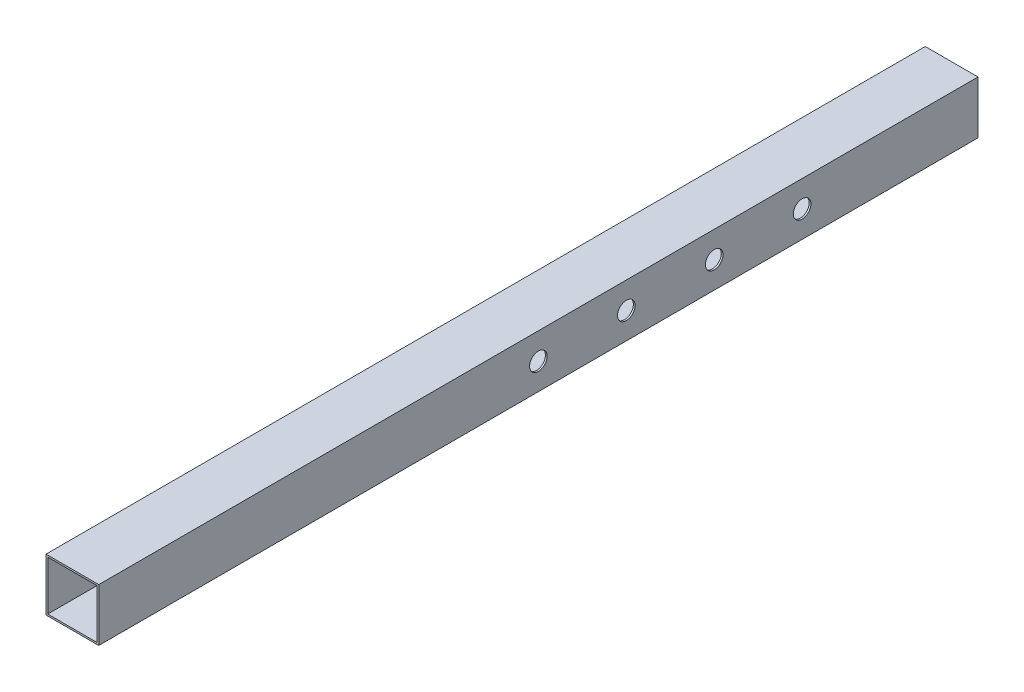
ISO-10303-21;
HEADER;
FILE_DESCRIPTION(('STEP AP214'),'2;1');
FILE_NAME('part.step','',(''),(''),'','','');
FILE_SCHEMA(('AUTOMOTIVE_DESIGN { 1 0 10303 214 1 1 1 1 }'));
ENDSEC;
DATA;
#1=APPLICATION_CONTEXT('core data for automotive mechanical design processes');
#2=APPLICATION_PROTOCOL_DEFINITION('international standard','automotive_design',2000,#1);
#3=PRODUCT_CONTEXT('',#1,'mechanical');
#4=PRODUCT('Part','Part','',(#3));
#5=PRODUCT_RELATED_PRODUCT_CATEGORY('part','',(#4));
#6=PRODUCT_DEFINITION_FORMATION('','',#4);
#7=PRODUCT_DEFINITION_CONTEXT('part definition',#1,'design');
#8=PRODUCT_DEFINITION('design','',#6,#7);
#9=PRODUCT_DEFINITION_SHAPE('','',#8);
#10=(LENGTH_UNIT() NAMED_UNIT(*) SI_UNIT(.MILLI.,.METRE.));
#11=(NAMED_UNIT(*) PLANE_ANGLE_UNIT() SI_UNIT($,.RADIAN.));
#12=(NAMED_UNIT(*) SI_UNIT($,.STERADIAN.) SOLID_ANGLE_UNIT());
#13=UNCERTAINTY_MEASURE_WITH_UNIT(LENGTH_MEASURE(1.E-05),#10,'distance_accuracy_value','');
#14=(GEOMETRIC_REPRESENTATION_CONTEXT(3) GLOBAL_UNCERTAINTY_ASSIGNED_CONTEXT((#13)) GLOBAL_UNIT_ASSIGNED_CONTEXT((#10,
#11,#12)) REPRESENTATION_CONTEXT('',''));
#15=CARTESIAN_POINT('',(0.,0.,0.));
#16=DIRECTION('',(0.,0.,1.));
#17=DIRECTION('',(1.,0.,0.));
#18=AXIS2_PLACEMENT_3D('',#15,#16,#17);
#19=CARTESIAN_POINT('',(0.,0.,500.));
#20=DIRECTION('',(0.,0.,1.));
#21=DIRECTION('',(1.,0.,0.));
#22=AXIS2_PLACEMENT_3D('',#19,#20,#21);
#23=PLANE('',#22);
#24=DIRECTION('',(0.,1.,0.));
#25=VECTOR('',#24,1.);
#26=CARTESIAN_POINT('',(15.,-15.,500.));
#27=LINE('',#26,#25);
#28=CARTESIAN_POINT('',(15.,-15.,500.));
#29=VERTEX_POINT('',#28);
#30=CARTESIAN_POINT('',(15.,15.,500.));
#31=VERTEX_POINT('',#30);
#32=EDGE_CURVE('E176',#29,#31,#27,.T.);
#33=ORIENTED_EDGE('',*,*,#32,.T.);
#34=DIRECTION('',(-1.,0.,0.));
#35=VECTOR('',#34,1.);
#36=CARTESIAN_POINT('',(-15.,15.,500.));
#37=LINE('',#36,#35);
#38=CARTESIAN_POINT('',(-15.,15.,500.));
#39=VERTEX_POINT('',#38);
#40=EDGE_CURVE('E179',#31,#39,#37,.T.);
#41=ORIENTED_EDGE('',*,*,#40,.T.);
#42=DIRECTION('',(0.,-1.,0.));
#43=VECTOR('',#42,1.);
#44=CARTESIAN_POINT('',(-15.,-15.,500.));
#45=LINE('',#44,#43);
#46=CARTESIAN_POINT('',(-15.,-15.,500.));
#47=VERTEX_POINT('',#46);
#48=EDGE_CURVE('E182',#39,#47,#45,.T.);
#49=ORIENTED_EDGE('',*,*,#48,.T.);
#50=DIRECTION('',(1.,0.,0.));
#51=VECTOR('',#50,1.);
#52=CARTESIAN_POINT('',(-15.,-15.,500.));
#53=LINE('',#52,#51);
#54=EDGE_CURVE('E184',#47,#29,#53,.T.);
#55=ORIENTED_EDGE('',*,*,#54,.T.);
#56=EDGE_LOOP('',(#33,#41,#49,#55));
#57=FACE_BOUND('',#56,.T.);
#58=DIRECTION('',(-1.,0.,0.));
#59=VECTOR('',#58,1.);
#60=CARTESIAN_POINT('',(0.,14.,500.));
#61=LINE('',#60,#59);
#62=CARTESIAN_POINT('',(14.,14.,500.));
#63=VERTEX_POINT('',#62);
#64=CARTESIAN_POINT('',(-14.,14.,500.));
#65=VERTEX_POINT('',#64);
#66=EDGE_CURVE('E146',#63,#65,#61,.T.);
#67=ORIENTED_EDGE('',*,*,#66,.F.);
#68=DIRECTION('',(0.,1.,0.));
#69=VECTOR('',#68,1.);
#70=CARTESIAN_POINT('',(14.,0.,500.));
#71=LINE('',#70,#69);
#72=CARTESIAN_POINT('',(14.,-14.,500.));
#73=VERTEX_POINT('',#72);
#74=EDGE_CURVE('E138',#73,#63,#71,.T.);
#75=ORIENTED_EDGE('',*,*,#74,.F.);
#76=DIRECTION('',(1.,0.,0.));
#77=VECTOR('',#76,1.);
#78=CARTESIAN_POINT('',(0.,-14.,500.));
#79=LINE('',#78,#77);
#80=CARTESIAN_POINT('',(-14.,-14.,500.));
#81=VERTEX_POINT('',#80);
#82=EDGE_CURVE('E160',#81,#73,#79,.T.);
#83=ORIENTED_EDGE('',*,*,#82,.F.);
#84=DIRECTION('',(0.,-1.,0.));
#85=VECTOR('',#84,1.);
#86=CARTESIAN_POINT('',(-14.,0.,500.));
#87=LINE('',#86,#85);
#88=EDGE_CURVE('E158',#65,#81,#87,.T.);
#89=ORIENTED_EDGE('',*,*,#88,.F.);
#90=EDGE_LOOP('',(#67,#75,#83,#89));
#91=FACE_BOUND('',#90,.T.);
#92=ADVANCED_FACE('F70',(#57,#91),#23,.T.);
#93=CARTESIAN_POINT('',(0.,0.,0.));
#94=DIRECTION('',(0.,0.,1.));
#95=DIRECTION('',(1.,0.,0.));
#96=AXIS2_PLACEMENT_3D('',#93,#94,#95);
#97=PLANE('',#96);
#98=DIRECTION('',(0.,1.,0.));
#99=VECTOR('',#98,1.);
#100=CARTESIAN_POINT('',(15.,-15.,0.));
#101=LINE('',#100,#99);
#102=CARTESIAN_POINT('',(15.,-15.,0.));
#103=VERTEX_POINT('',#102);
#104=CARTESIAN_POINT('',(15.,15.,0.));
#105=VERTEX_POINT('',#104);
#106=EDGE_CURVE('E154',#103,#105,#101,.T.);
#107=ORIENTED_EDGE('',*,*,#106,.F.);
#108=DIRECTION('',(1.,0.,0.));
#109=VECTOR('',#108,1.);
#110=CARTESIAN_POINT('',(-15.,-15.,0.));
#111=LINE('',#110,#109);
#112=CARTESIAN_POINT('',(-15.,-15.,0.));
#113=VERTEX_POINT('',#112);
#114=EDGE_CURVE('E180',#113,#103,#111,.T.);
#115=ORIENTED_EDGE('',*,*,#114,.F.);
#116=DIRECTION('',(0.,-1.,0.));
#117=VECTOR('',#116,1.);
#118=CARTESIAN_POINT('',(-15.,-15.,0.));
#119=LINE('',#118,#117);
#120=CARTESIAN_POINT('',(-15.,15.,0.));
#121=VERTEX_POINT('',#120);
#122=EDGE_CURVE('E191',#121,#113,#119,.T.);
#123=ORIENTED_EDGE('',*,*,#122,.F.);
#124=DIRECTION('',(-1.,0.,0.));
#125=VECTOR('',#124,1.);
#126=CARTESIAN_POINT('',(-15.,15.,0.));
#127=LINE('',#126,#125);
#128=EDGE_CURVE('E189',#105,#121,#127,.T.);
#129=ORIENTED_EDGE('',*,*,#128,.F.);
#130=EDGE_LOOP('',(#107,#115,#123,#129));
#131=FACE_BOUND('',#130,.T.);
#132=DIRECTION('',(0.,1.,0.));
#133=VECTOR('',#132,1.);
#134=CARTESIAN_POINT('',(14.,0.,0.));
#135=LINE('',#134,#133);
#136=CARTESIAN_POINT('',(14.,-14.,0.));
#137=VERTEX_POINT('',#136);
#138=CARTESIAN_POINT('',(14.,14.,0.));
#139=VERTEX_POINT('',#138);
#140=EDGE_CURVE('E96',#137,#139,#135,.T.);
#141=ORIENTED_EDGE('',*,*,#140,.T.);
#142=DIRECTION('',(-1.,0.,0.));
#143=VECTOR('',#142,1.);
#144=CARTESIAN_POINT('',(0.,14.,0.));
#145=LINE('',#144,#143);
#146=CARTESIAN_POINT('',(-14.,14.,0.));
#147=VERTEX_POINT('',#146);
#148=EDGE_CURVE('E153',#139,#147,#145,.T.);
#149=ORIENTED_EDGE('',*,*,#148,.T.);
#150=DIRECTION('',(0.,-1.,0.));
#151=VECTOR('',#150,1.);
#152=CARTESIAN_POINT('',(-14.,0.,0.));
#153=LINE('',#152,#151);
#154=CARTESIAN_POINT('',(-14.,-14.,0.));
#155=VERTEX_POINT('',#154);
#156=EDGE_CURVE('E168',#147,#155,#153,.T.);
#157=ORIENTED_EDGE('',*,*,#156,.T.);
#158=DIRECTION('',(1.,0.,0.));
#159=VECTOR('',#158,1.);
#160=CARTESIAN_POINT('',(0.,-14.,0.));
#161=LINE('',#160,#159);
#162=EDGE_CURVE('E147',#155,#137,#161,.T.);
#163=ORIENTED_EDGE('',*,*,#162,.T.);
#164=EDGE_LOOP('',(#141,#149,#157,#163));
#165=FACE_BOUND('',#164,.T.);
#166=ADVANCED_FACE('F245',(#131,#165),#97,.F.);
#167=CARTESIAN_POINT('',(15.,-15.,500.));
#168=DIRECTION('',(-1.,0.,0.));
#169=DIRECTION('',(0.,0.,1.));
#170=AXIS2_PLACEMENT_3D('',#167,#168,#169);
#171=PLANE('',#170);
#172=CARTESIAN_POINT('',(15.,0.,100.));
#173=DIRECTION('',(1.,0.,0.));
#174=DIRECTION('',(0.,0.,-1.));
#175=AXIS2_PLACEMENT_3D('',#172,#173,#174);
#176=CIRCLE('',#175,5.);
#177=CARTESIAN_POINT('',(15.,0.,95.));
#178=VERTEX_POINT('',#177);
#179=EDGE_CURVE('E298',#178,#178,#176,.T.);
#180=ORIENTED_EDGE('',*,*,#179,.F.);
#181=EDGE_LOOP('',(#180));
#182=FACE_BOUND('',#181,.T.);
#183=CARTESIAN_POINT('',(15.,-3.49148133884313E-13,150.));
#184=DIRECTION('',(1.,0.,0.));
#185=DIRECTION('',(0.,0.,-1.));
#186=AXIS2_PLACEMENT_3D('',#183,#184,#185);
#187=CIRCLE('',#186,4.99999999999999);
#188=CARTESIAN_POINT('',(15.,-3.49148133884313E-13,145.));
#189=VERTEX_POINT('',#188);
#190=EDGE_CURVE('E302',#189,#189,#187,.T.);
#191=ORIENTED_EDGE('',*,*,#190,.F.);
#192=EDGE_LOOP('',(#191));
#193=FACE_BOUND('',#192,.T.);
#194=CARTESIAN_POINT('',(15.,-6.98296267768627E-13,200.));
#195=DIRECTION('',(1.,0.,0.));
#196=DIRECTION('',(0.,0.,-1.));
#197=AXIS2_PLACEMENT_3D('',#194,#195,#196);
#198=CIRCLE('',#197,4.99999999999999);
#199=CARTESIAN_POINT('',(15.,-6.98296267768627E-13,195.));
#200=VERTEX_POINT('',#199);
#201=EDGE_CURVE('E306',#200,#200,#198,.T.);
#202=ORIENTED_EDGE('',*,*,#201,.F.);
#203=EDGE_LOOP('',(#202));
#204=FACE_BOUND('',#203,.T.);
#205=CARTESIAN_POINT('',(15.,-1.04744440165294E-12,250.));
#206=DIRECTION('',(1.,0.,0.));
#207=DIRECTION('',(0.,0.,-1.));
#208=AXIS2_PLACEMENT_3D('',#205,#206,#207);
#209=CIRCLE('',#208,4.99999999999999);
#210=CARTESIAN_POINT('',(15.,-1.04744440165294E-12,245.));
#211=VERTEX_POINT('',#210);
#212=EDGE_CURVE('E309',#211,#211,#209,.T.);
#213=ORIENTED_EDGE('',*,*,#212,.F.);
#214=EDGE_LOOP('',(#213));
#215=FACE_BOUND('',#214,.T.);
#216=ORIENTED_EDGE('',*,*,#106,.T.);
#217=DIRECTION('',(0.,0.,-1.));
#218=VECTOR('',#217,1.);
#219=CARTESIAN_POINT('',(15.,15.,500.));
#220=LINE('',#219,#218);
#221=EDGE_CURVE('E13',#31,#105,#220,.T.);
#222=ORIENTED_EDGE('',*,*,#221,.F.);
#223=ORIENTED_EDGE('',*,*,#32,.F.);
#224=DIRECTION('',(0.,0.,-1.));
#225=VECTOR('',#224,1.);
#226=CARTESIAN_POINT('',(15.,-15.,500.));
#227=LINE('',#226,#225);
#228=EDGE_CURVE('E186',#29,#103,#227,.T.);
#229=ORIENTED_EDGE('',*,*,#228,.T.);
#230=EDGE_LOOP('',(#216,#222,#223,#229));
#231=FACE_BOUND('',#230,.T.);
#232=ADVANCED_FACE('F72',(#182,#193,#204,#215,#231),#171,.F.);
#233=CARTESIAN_POINT('',(-15.,15.,500.));
#234=DIRECTION('',(0.,-1.,0.));
#235=DIRECTION('',(0.,0.,-1.));
#236=AXIS2_PLACEMENT_3D('',#233,#234,#235);
#237=PLANE('',#236);
#238=ORIENTED_EDGE('',*,*,#128,.T.);
#239=DIRECTION('',(0.,0.,-1.));
#240=VECTOR('',#239,1.);
#241=CARTESIAN_POINT('',(-15.,15.,500.));
#242=LINE('',#241,#240);
#243=EDGE_CURVE('E80',#39,#121,#242,.T.);
#244=ORIENTED_EDGE('',*,*,#243,.F.);
#245=ORIENTED_EDGE('',*,*,#40,.F.);
#246=ORIENTED_EDGE('',*,*,#221,.T.);
#247=EDGE_LOOP('',(#238,#244,#245,#246));
#248=FACE_BOUND('',#247,.T.);
#249=ADVANCED_FACE('F273',(#248),#237,.F.);
#250=CARTESIAN_POINT('',(-15.,-15.,500.));
#251=DIRECTION('',(1.,0.,0.));
#252=DIRECTION('',(0.,0.,-1.));
#253=AXIS2_PLACEMENT_3D('',#250,#251,#252);
#254=PLANE('',#253);
#255=CARTESIAN_POINT('',(-15.,0.,100.));
#256=DIRECTION('',(1.,0.,0.));
#257=DIRECTION('',(0.,0.,-1.));
#258=AXIS2_PLACEMENT_3D('',#255,#256,#257);
#259=CIRCLE('',#258,5.);
#260=CARTESIAN_POINT('',(-15.,0.,95.));
#261=VERTEX_POINT('',#260);
#262=EDGE_CURVE('E206',#261,#261,#259,.F.);
#263=ORIENTED_EDGE('',*,*,#262,.F.);
#264=EDGE_LOOP('',(#263));
#265=FACE_BOUND('',#264,.T.);
#266=CARTESIAN_POINT('',(-15.,-3.49148133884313E-13,150.));
#267=DIRECTION('',(1.,0.,0.));
#268=DIRECTION('',(0.,0.,-1.));
#269=AXIS2_PLACEMENT_3D('',#266,#267,#268);
#270=CIRCLE('',#269,4.99999999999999);
#271=CARTESIAN_POINT('',(-15.,-3.49148133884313E-13,145.));
#272=VERTEX_POINT('',#271);
#273=EDGE_CURVE('E323',#272,#272,#270,.F.);
#274=ORIENTED_EDGE('',*,*,#273,.F.);
#275=EDGE_LOOP('',(#274));
#276=FACE_BOUND('',#275,.T.);
#277=CARTESIAN_POINT('',(-15.,-6.98296267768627E-13,200.));
#278=DIRECTION('',(1.,0.,0.));
#279=DIRECTION('',(0.,0.,-1.));
#280=AXIS2_PLACEMENT_3D('',#277,#278,#279);
#281=CIRCLE('',#280,4.99999999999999);
#282=CARTESIAN_POINT('',(-15.,-6.98296267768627E-13,195.));
#283=VERTEX_POINT('',#282);
#284=EDGE_CURVE('E319',#283,#283,#281,.F.);
#285=ORIENTED_EDGE('',*,*,#284,.F.);
#286=EDGE_LOOP('',(#285));
#287=FACE_BOUND('',#286,.T.);
#288=CARTESIAN_POINT('',(-15.,-1.04744440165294E-12,250.));
#289=DIRECTION('',(1.,0.,0.));
#290=DIRECTION('',(0.,0.,-1.));
#291=AXIS2_PLACEMENT_3D('',#288,#289,#290);
#292=CIRCLE('',#291,4.99999999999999);
#293=CARTESIAN_POINT('',(-15.,-1.04744440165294E-12,245.));
#294=VERTEX_POINT('',#293);
#295=EDGE_CURVE('E312',#294,#294,#292,.F.);
#296=ORIENTED_EDGE('',*,*,#295,.F.);
#297=EDGE_LOOP('',(#296));
#298=FACE_BOUND('',#297,.T.);
#299=ORIENTED_EDGE('',*,*,#122,.T.);
#300=DIRECTION('',(0.,0.,-1.));
#301=VECTOR('',#300,1.);
#302=CARTESIAN_POINT('',(-15.,-15.,500.));
#303=LINE('',#302,#301);
#304=EDGE_CURVE('E196',#47,#113,#303,.T.);
#305=ORIENTED_EDGE('',*,*,#304,.F.);
#306=ORIENTED_EDGE('',*,*,#48,.F.);
#307=ORIENTED_EDGE('',*,*,#243,.T.);
#308=EDGE_LOOP('',(#299,#305,#306,#307));
#309=FACE_BOUND('',#308,.T.);
#310=ADVANCED_FACE('F270',(#265,#276,#287,#298,#309),#254,.F.);
#311=CARTESIAN_POINT('',(-15.,-15.,500.));
#312=DIRECTION('',(0.,1.,0.));
#313=DIRECTION('',(0.,0.,1.));
#314=AXIS2_PLACEMENT_3D('',#311,#312,#313);
#315=PLANE('',#314);
#316=ORIENTED_EDGE('',*,*,#114,.T.);
#317=ORIENTED_EDGE('',*,*,#228,.F.);
#318=ORIENTED_EDGE('',*,*,#54,.F.);
#319=ORIENTED_EDGE('',*,*,#304,.T.);
#320=EDGE_LOOP('',(#316,#317,#318,#319));
#321=FACE_BOUND('',#320,.T.);
#322=ADVANCED_FACE('F267',(#321),#315,.F.);
#323=CARTESIAN_POINT('',(14.,0.,500.));
#324=DIRECTION('',(-1.,0.,0.));
#325=DIRECTION('',(0.,0.,1.));
#326=AXIS2_PLACEMENT_3D('',#323,#324,#325);
#327=PLANE('',#326);
#328=CARTESIAN_POINT('',(14.,0.,100.));
#329=DIRECTION('',(-1.,0.,0.));
#330=DIRECTION('',(0.,0.,1.));
#331=AXIS2_PLACEMENT_3D('',#328,#329,#330);
#332=CIRCLE('',#331,5.);
#333=CARTESIAN_POINT('',(14.,0.,105.));
#334=VERTEX_POINT('',#333);
#335=EDGE_CURVE('E166',#334,#334,#332,.T.);
#336=ORIENTED_EDGE('',*,*,#335,.F.);
#337=EDGE_LOOP('',(#336));
#338=FACE_BOUND('',#337,.T.);
#339=CARTESIAN_POINT('',(14.,-3.49148133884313E-13,150.));
#340=DIRECTION('',(-1.,0.,0.));
#341=DIRECTION('',(0.,0.,1.));
#342=AXIS2_PLACEMENT_3D('',#339,#340,#341);
#343=CIRCLE('',#342,4.99999999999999);
#344=CARTESIAN_POINT('',(14.,-3.49148133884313E-13,155.));
#345=VERTEX_POINT('',#344);
#346=EDGE_CURVE('E213',#345,#345,#343,.T.);
#347=ORIENTED_EDGE('',*,*,#346,.F.);
#348=EDGE_LOOP('',(#347));
#349=FACE_BOUND('',#348,.T.);
#350=CARTESIAN_POINT('',(14.,-6.98296267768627E-13,200.));
#351=DIRECTION('',(-1.,0.,0.));
#352=DIRECTION('',(0.,0.,1.));
#353=AXIS2_PLACEMENT_3D('',#350,#351,#352);
#354=CIRCLE('',#353,4.99999999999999);
#355=CARTESIAN_POINT('',(14.,-6.98296267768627E-13,205.));
#356=VERTEX_POINT('',#355);
#357=EDGE_CURVE('E210',#356,#356,#354,.T.);
#358=ORIENTED_EDGE('',*,*,#357,.F.);
#359=EDGE_LOOP('',(#358));
#360=FACE_BOUND('',#359,.T.);
#361=CARTESIAN_POINT('',(14.,-1.04744440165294E-12,250.));
#362=DIRECTION('',(-1.,0.,0.));
#363=DIRECTION('',(0.,0.,1.));
#364=AXIS2_PLACEMENT_3D('',#361,#362,#363);
#365=CIRCLE('',#364,4.99999999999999);
#366=CARTESIAN_POINT('',(14.,-1.04744440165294E-12,255.));
#367=VERTEX_POINT('',#366);
#368=EDGE_CURVE('E205',#367,#367,#365,.T.);
#369=ORIENTED_EDGE('',*,*,#368,.F.);
#370=EDGE_LOOP('',(#369));
#371=FACE_BOUND('',#370,.T.);
#372=ORIENTED_EDGE('',*,*,#140,.F.);
#373=DIRECTION('',(0.,0.,-1.));
#374=VECTOR('',#373,1.);
#375=CARTESIAN_POINT('',(14.,-14.,500.));
#376=LINE('',#375,#374);
#377=EDGE_CURVE('E142',#73,#137,#376,.T.);
#378=ORIENTED_EDGE('',*,*,#377,.F.);
#379=ORIENTED_EDGE('',*,*,#74,.T.);
#380=DIRECTION('',(0.,0.,-1.));
#381=VECTOR('',#380,1.);
#382=CARTESIAN_POINT('',(14.,14.,500.));
#383=LINE('',#382,#381);
#384=EDGE_CURVE('E141',#63,#139,#383,.T.);
#385=ORIENTED_EDGE('',*,*,#384,.T.);
#386=EDGE_LOOP('',(#372,#378,#379,#385));
#387=FACE_BOUND('',#386,.T.);
#388=ADVANCED_FACE('F140',(#338,#349,#360,#371,#387),#327,.T.);
#389=CARTESIAN_POINT('',(0.,14.,500.));
#390=DIRECTION('',(0.,-1.,0.));
#391=DIRECTION('',(0.,0.,-1.));
#392=AXIS2_PLACEMENT_3D('',#389,#390,#391);
#393=PLANE('',#392);
#394=ORIENTED_EDGE('',*,*,#148,.F.);
#395=ORIENTED_EDGE('',*,*,#384,.F.);
#396=ORIENTED_EDGE('',*,*,#66,.T.);
#397=DIRECTION('',(0.,0.,-1.));
#398=VECTOR('',#397,1.);
#399=CARTESIAN_POINT('',(-14.,14.,500.));
#400=LINE('',#399,#398);
#401=EDGE_CURVE('E155',#65,#147,#400,.T.);
#402=ORIENTED_EDGE('',*,*,#401,.T.);
#403=EDGE_LOOP('',(#394,#395,#396,#402));
#404=FACE_BOUND('',#403,.T.);
#405=ADVANCED_FACE('F150',(#404),#393,.T.);
#406=CARTESIAN_POINT('',(-14.,0.,500.));
#407=DIRECTION('',(1.,0.,0.));
#408=DIRECTION('',(0.,0.,-1.));
#409=AXIS2_PLACEMENT_3D('',#406,#407,#408);
#410=PLANE('',#409);
#411=CARTESIAN_POINT('',(-14.,0.,100.));
#412=DIRECTION('',(1.,0.,0.));
#413=DIRECTION('',(0.,0.,-1.));
#414=AXIS2_PLACEMENT_3D('',#411,#412,#413);
#415=CIRCLE('',#414,5.);
#416=CARTESIAN_POINT('',(-14.,0.,95.));
#417=VERTEX_POINT('',#416);
#418=EDGE_CURVE('E74',#417,#417,#415,.T.);
#419=ORIENTED_EDGE('',*,*,#418,.F.);
#420=EDGE_LOOP('',(#419));
#421=FACE_BOUND('',#420,.T.);
#422=CARTESIAN_POINT('',(-14.,-3.49148133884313E-13,150.));
#423=DIRECTION('',(1.,0.,0.));
#424=DIRECTION('',(0.,0.,-1.));
#425=AXIS2_PLACEMENT_3D('',#422,#423,#424);
#426=CIRCLE('',#425,4.99999999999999);
#427=CARTESIAN_POINT('',(-14.,-3.49148133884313E-13,145.));
#428=VERTEX_POINT('',#427);
#429=EDGE_CURVE('E211',#428,#428,#426,.T.);
#430=ORIENTED_EDGE('',*,*,#429,.F.);
#431=EDGE_LOOP('',(#430));
#432=FACE_BOUND('',#431,.T.);
#433=CARTESIAN_POINT('',(-14.,-6.98296267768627E-13,200.));
#434=DIRECTION('',(1.,0.,0.));
#435=DIRECTION('',(0.,0.,-1.));
#436=AXIS2_PLACEMENT_3D('',#433,#434,#435);
#437=CIRCLE('',#436,4.99999999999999);
#438=CARTESIAN_POINT('',(-14.,-6.98296267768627E-13,195.));
#439=VERTEX_POINT('',#438);
#440=EDGE_CURVE('E207',#439,#439,#437,.T.);
#441=ORIENTED_EDGE('',*,*,#440,.F.);
#442=EDGE_LOOP('',(#441));
#443=FACE_BOUND('',#442,.T.);
#444=CARTESIAN_POINT('',(-14.,-1.04744440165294E-12,250.));
#445=DIRECTION('',(1.,0.,0.));
#446=DIRECTION('',(0.,0.,-1.));
#447=AXIS2_PLACEMENT_3D('',#444,#445,#446);
#448=CIRCLE('',#447,4.99999999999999);
#449=CARTESIAN_POINT('',(-14.,-1.04744440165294E-12,245.));
#450=VERTEX_POINT('',#449);
#451=EDGE_CURVE('E200',#450,#450,#448,.T.);
#452=ORIENTED_EDGE('',*,*,#451,.F.);
#453=EDGE_LOOP('',(#452));
#454=FACE_BOUND('',#453,.T.);
#455=ORIENTED_EDGE('',*,*,#156,.F.);
#456=ORIENTED_EDGE('',*,*,#401,.F.);
#457=ORIENTED_EDGE('',*,*,#88,.T.);
#458=DIRECTION('',(0.,0.,-1.));
#459=VECTOR('',#458,1.);
#460=CARTESIAN_POINT('',(-14.,-14.,500.));
#461=LINE('',#460,#459);
#462=EDGE_CURVE('E88',#81,#155,#461,.T.);
#463=ORIENTED_EDGE('',*,*,#462,.T.);
#464=EDGE_LOOP('',(#455,#456,#457,#463));
#465=FACE_BOUND('',#464,.T.);
#466=ADVANCED_FACE('F233',(#421,#432,#443,#454,#465),#410,.T.);
#467=CARTESIAN_POINT('',(0.,-14.,500.));
#468=DIRECTION('',(0.,1.,0.));
#469=DIRECTION('',(0.,0.,1.));
#470=AXIS2_PLACEMENT_3D('',#467,#468,#469);
#471=PLANE('',#470);
#472=ORIENTED_EDGE('',*,*,#162,.F.);
#473=ORIENTED_EDGE('',*,*,#462,.F.);
#474=ORIENTED_EDGE('',*,*,#82,.T.);
#475=ORIENTED_EDGE('',*,*,#377,.T.);
#476=EDGE_LOOP('',(#472,#473,#474,#475));
#477=FACE_BOUND('',#476,.T.);
#478=ADVANCED_FACE('F236',(#477),#471,.T.);
#479=CARTESIAN_POINT('',(-29.142135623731,-1.04744440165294E-12,250.));
#480=DIRECTION('',(1.,0.,0.));
#481=DIRECTION('',(0.,0.,-1.));
#482=AXIS2_PLACEMENT_3D('',#479,#480,#481);
#483=CYLINDRICAL_SURFACE('',#482,4.99999999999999);
#484=ORIENTED_EDGE('',*,*,#451,.T.);
#485=EDGE_LOOP('',(#484));
#486=FACE_BOUND('',#485,.T.);
#487=ORIENTED_EDGE('',*,*,#295,.T.);
#488=EDGE_LOOP('',(#487));
#489=FACE_BOUND('',#488,.T.);
#490=ADVANCED_FACE('F247',(#486,#489),#483,.F.);
#491=CARTESIAN_POINT('',(-29.142135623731,-6.98296267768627E-13,200.));
#492=DIRECTION('',(1.,0.,0.));
#493=DIRECTION('',(0.,0.,-1.));
#494=AXIS2_PLACEMENT_3D('',#491,#492,#493);
#495=CYLINDRICAL_SURFACE('',#494,4.99999999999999);
#496=ORIENTED_EDGE('',*,*,#440,.T.);
#497=EDGE_LOOP('',(#496));
#498=FACE_BOUND('',#497,.T.);
#499=ORIENTED_EDGE('',*,*,#284,.T.);
#500=EDGE_LOOP('',(#499));
#501=FACE_BOUND('',#500,.T.);
#502=ADVANCED_FACE('F252',(#498,#501),#495,.F.);
#503=CARTESIAN_POINT('',(-29.142135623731,-3.49148133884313E-13,150.));
#504=DIRECTION('',(1.,0.,0.));
#505=DIRECTION('',(0.,0.,-1.));
#506=AXIS2_PLACEMENT_3D('',#503,#504,#505);
#507=CYLINDRICAL_SURFACE('',#506,4.99999999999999);
#508=ORIENTED_EDGE('',*,*,#429,.T.);
#509=EDGE_LOOP('',(#508));
#510=FACE_BOUND('',#509,.T.);
#511=ORIENTED_EDGE('',*,*,#273,.T.);
#512=EDGE_LOOP('',(#511));
#513=FACE_BOUND('',#512,.T.);
#514=ADVANCED_FACE('F340',(#510,#513),#507,.F.);
#515=CARTESIAN_POINT('',(-29.142135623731,0.,100.));
#516=DIRECTION('',(1.,0.,0.));
#517=DIRECTION('',(0.,0.,-1.));
#518=AXIS2_PLACEMENT_3D('',#515,#516,#517);
#519=CYLINDRICAL_SURFACE('',#518,5.);
#520=ORIENTED_EDGE('',*,*,#418,.T.);
#521=EDGE_LOOP('',(#520));
#522=FACE_BOUND('',#521,.T.);
#523=ORIENTED_EDGE('',*,*,#262,.T.);
#524=EDGE_LOOP('',(#523));
#525=FACE_BOUND('',#524,.T.);
#526=ADVANCED_FACE('F230',(#522,#525),#519,.F.);
#527=ORIENTED_EDGE('',*,*,#368,.T.);
#528=EDGE_LOOP('',(#527));
#529=FACE_BOUND('',#528,.T.);
#530=ORIENTED_EDGE('',*,*,#212,.T.);
#531=EDGE_LOOP('',(#530));
#532=FACE_BOUND('',#531,.T.);
#533=ADVANCED_FACE('F255',(#529,#532),#483,.F.);
#534=ORIENTED_EDGE('',*,*,#357,.T.);
#535=EDGE_LOOP('',(#534));
#536=FACE_BOUND('',#535,.T.);
#537=ORIENTED_EDGE('',*,*,#201,.T.);
#538=EDGE_LOOP('',(#537));
#539=FACE_BOUND('',#538,.T.);
#540=ADVANCED_FACE('F337',(#536,#539),#495,.F.);
#541=ORIENTED_EDGE('',*,*,#346,.T.);
#542=EDGE_LOOP('',(#541));
#543=FACE_BOUND('',#542,.T.);
#544=ORIENTED_EDGE('',*,*,#190,.T.);
#545=EDGE_LOOP('',(#544));
#546=FACE_BOUND('',#545,.T.);
#547=ADVANCED_FACE('F332',(#543,#546),#507,.F.);
#548=ORIENTED_EDGE('',*,*,#335,.T.);
#549=EDGE_LOOP('',(#548));
#550=FACE_BOUND('',#549,.T.);
#551=ORIENTED_EDGE('',*,*,#179,.T.);
#552=EDGE_LOOP('',(#551));
#553=FACE_BOUND('',#552,.T.);
#554=ADVANCED_FACE('F330',(#550,#553),#519,.F.);
#555=CLOSED_SHELL('',(#92,#166,#232,#249,#310,#322,#388,#405,#466,#478,#490,#502,#514,#526,#533,
#540,#547,#554));
#556=MANIFOLD_SOLID_BREP('B2',#555);
#557=ADVANCED_BREP_SHAPE_REPRESENTATION('',(#18,#556),#14);
#558=SHAPE_DEFINITION_REPRESENTATION(#9,#557);
ENDSEC;
END-ISO-10303-21;
